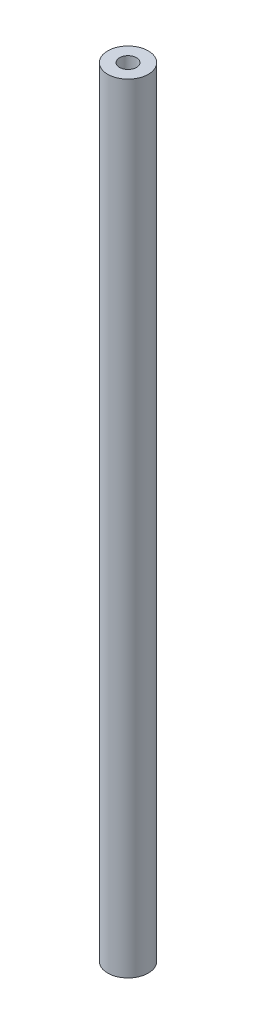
ISO-10303-21;
HEADER;
FILE_DESCRIPTION(('STEP AP214'),'2;1');
FILE_NAME('part.step','',(''),(''),'','','');
FILE_SCHEMA(('AUTOMOTIVE_DESIGN { 1 0 10303 214 1 1 1 1 }'));
ENDSEC;
DATA;
#1=APPLICATION_CONTEXT('core data for automotive mechanical design processes');
#2=APPLICATION_PROTOCOL_DEFINITION('international standard','automotive_design',2000,#1);
#3=PRODUCT_CONTEXT('',#1,'mechanical');
#4=PRODUCT('Part','Part','',(#3));
#5=PRODUCT_RELATED_PRODUCT_CATEGORY('part','',(#4));
#6=PRODUCT_DEFINITION_FORMATION('','',#4);
#7=PRODUCT_DEFINITION_CONTEXT('part definition',#1,'design');
#8=PRODUCT_DEFINITION('design','',#6,#7);
#9=PRODUCT_DEFINITION_SHAPE('','',#8);
#10=(LENGTH_UNIT() NAMED_UNIT(*) SI_UNIT(.MILLI.,.METRE.));
#11=(NAMED_UNIT(*) PLANE_ANGLE_UNIT() SI_UNIT($,.RADIAN.));
#12=(NAMED_UNIT(*) SI_UNIT($,.STERADIAN.) SOLID_ANGLE_UNIT());
#13=UNCERTAINTY_MEASURE_WITH_UNIT(LENGTH_MEASURE(1.E-05),#10,'distance_accuracy_value','');
#14=(GEOMETRIC_REPRESENTATION_CONTEXT(3) GLOBAL_UNCERTAINTY_ASSIGNED_CONTEXT((#13)) GLOBAL_UNIT_ASSIGNED_CONTEXT((#10,
#11,#12)) REPRESENTATION_CONTEXT('',''));
#15=CARTESIAN_POINT('',(0.,0.,0.));
#16=DIRECTION('',(0.,0.,1.));
#17=DIRECTION('',(1.,0.,0.));
#18=AXIS2_PLACEMENT_3D('',#15,#16,#17);
#19=CARTESIAN_POINT('',(0.,214.999999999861,0.));
#20=DIRECTION('',(0.,1.,0.));
#21=DIRECTION('',(0.,0.,1.));
#22=AXIS2_PLACEMENT_3D('',#19,#20,#21);
#23=CONICAL_SURFACE('',#22,2.4999999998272,1.02974425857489);
#24=CARTESIAN_POINT('',(0.,213.497848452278,0.));
#25=VERTEX_POINT('',#24);
#26=VERTEX_LOOP('',#25);
#27=FACE_BOUND('',#26,.T.);
#28=CARTESIAN_POINT('',(0.,215.,0.));
#29=DIRECTION('',(0.,1.,0.));
#30=DIRECTION('',(0.,0.,1.));
#31=AXIS2_PLACEMENT_3D('',#28,#29,#30);
#32=CIRCLE('',#31,2.5);
#33=CARTESIAN_POINT('',(0.,215.,2.5));
#34=VERTEX_POINT('',#33);
#35=EDGE_CURVE('E33',#34,#34,#32,.T.);
#36=ORIENTED_EDGE('',*,*,#35,.T.);
#37=EDGE_LOOP('',(#36));
#38=FACE_BOUND('',#37,.T.);
#39=ADVANCED_FACE('F17',(#27,#38),#23,.F.);
#40=CARTESIAN_POINT('',(0.,230.,0.));
#41=DIRECTION('',(0.,1.,0.));
#42=DIRECTION('',(0.,0.,1.));
#43=AXIS2_PLACEMENT_3D('',#40,#41,#42);
#44=CYLINDRICAL_SURFACE('',#43,2.5);
#45=CARTESIAN_POINT('',(0.,230.,0.));
#46=DIRECTION('',(0.,1.,0.));
#47=DIRECTION('',(0.,0.,1.));
#48=AXIS2_PLACEMENT_3D('',#45,#46,#47);
#49=CIRCLE('',#48,2.5);
#50=CARTESIAN_POINT('',(0.,230.,2.5));
#51=VERTEX_POINT('',#50);
#52=EDGE_CURVE('E20',#51,#51,#49,.F.);
#53=ORIENTED_EDGE('',*,*,#52,.F.);
#54=EDGE_LOOP('',(#53));
#55=FACE_BOUND('',#54,.T.);
#56=ORIENTED_EDGE('',*,*,#35,.F.);
#57=EDGE_LOOP('',(#56));
#58=FACE_BOUND('',#57,.T.);
#59=ADVANCED_FACE('F30',(#55,#58),#44,.F.);
#60=CARTESIAN_POINT('',(0.,230.,0.));
#61=DIRECTION('',(0.,1.,0.));
#62=DIRECTION('',(0.,0.,1.));
#63=AXIS2_PLACEMENT_3D('',#60,#61,#62);
#64=PLANE('',#63);
#65=CARTESIAN_POINT('',(0.,230.,0.));
#66=DIRECTION('',(0.,-1.,0.));
#67=DIRECTION('',(0.,0.,-1.));
#68=AXIS2_PLACEMENT_3D('',#65,#66,#67);
#69=CIRCLE('',#68,6.);
#70=CARTESIAN_POINT('',(0.,230.,-6.));
#71=VERTEX_POINT('',#70);
#72=EDGE_CURVE('E24',#71,#71,#69,.T.);
#73=ORIENTED_EDGE('',*,*,#72,.F.);
#74=EDGE_LOOP('',(#73));
#75=FACE_BOUND('',#74,.T.);
#76=ORIENTED_EDGE('',*,*,#52,.T.);
#77=EDGE_LOOP('',(#76));
#78=FACE_BOUND('',#77,.T.);
#79=ADVANCED_FACE('F42',(#75,#78),#64,.T.);
#80=CARTESIAN_POINT('',(0.,0.,0.));
#81=DIRECTION('',(0.,1.,0.));
#82=DIRECTION('',(0.,0.,1.));
#83=AXIS2_PLACEMENT_3D('',#80,#81,#82);
#84=PLANE('',#83);
#85=CARTESIAN_POINT('',(0.,0.,0.));
#86=DIRECTION('',(0.,-1.,0.));
#87=DIRECTION('',(0.,0.,-1.));
#88=AXIS2_PLACEMENT_3D('',#85,#86,#87);
#89=CIRCLE('',#88,6.);
#90=CARTESIAN_POINT('',(0.,0.,-6.));
#91=VERTEX_POINT('',#90);
#92=EDGE_CURVE('E11',#91,#91,#89,.F.);
#93=ORIENTED_EDGE('',*,*,#92,.F.);
#94=EDGE_LOOP('',(#93));
#95=FACE_BOUND('',#94,.T.);
#96=ADVANCED_FACE('F45',(#95),#84,.F.);
#97=CARTESIAN_POINT('',(0.,230.,0.));
#98=DIRECTION('',(0.,-1.,0.));
#99=DIRECTION('',(0.,0.,-1.));
#100=AXIS2_PLACEMENT_3D('',#97,#98,#99);
#101=CYLINDRICAL_SURFACE('',#100,6.);
#102=ORIENTED_EDGE('',*,*,#92,.T.);
#103=EDGE_LOOP('',(#102));
#104=FACE_BOUND('',#103,.T.);
#105=ORIENTED_EDGE('',*,*,#72,.T.);
#106=EDGE_LOOP('',(#105));
#107=FACE_BOUND('',#106,.T.);
#108=ADVANCED_FACE('F40',(#104,#107),#101,.T.);
#109=CLOSED_SHELL('',(#39,#59,#79,#96,#108));
#110=MANIFOLD_SOLID_BREP('B1',#109);
#111=ADVANCED_BREP_SHAPE_REPRESENTATION('',(#18,#110),#14);
#112=SHAPE_DEFINITION_REPRESENTATION(#9,#111);
ENDSEC;
END-ISO-10303-21;
